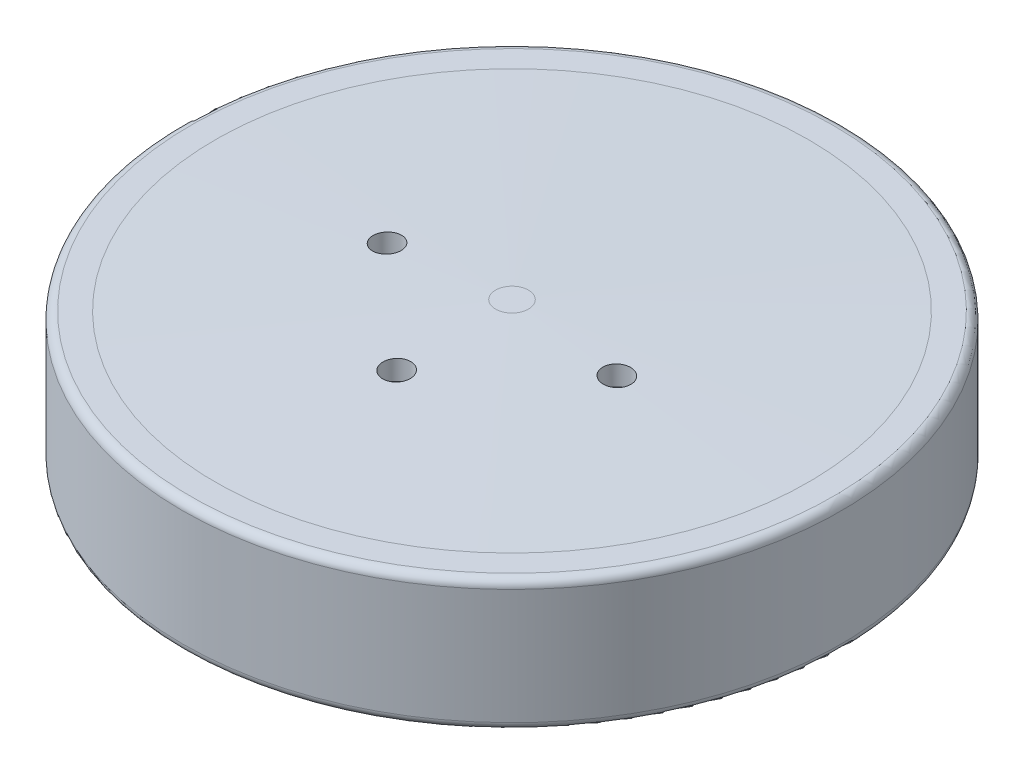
from build123d import *

# Parameters (mm, degrees)
CIRPATTERN1_COUNT                                    = 12
FILLET1_R                                            = 1.5875
F_1_4_28_TAPPED_HOLE1_D                              = 5.4102
CBORE_FOR_1_4_BINDING_HEAD_MACHINE_SCREW_D           = 2.54
CBORE_FOR_1_4_BINDING_HEAD_MACHINE_SCREW_DEPTH       = 9.2964
CBORE_FOR_1_4_BINDING_HEAD_MACHINE_SCREW_CBORE_D     = 14.2875
CBORE_FOR_1_4_BINDING_HEAD_MACHINE_SCREW_CBORE_DEPTH = 5.08
CBORE_FOR_1_4_BINDING_HEAD_MACHINE_SCREW_TIP         = 0.763092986


with BuildPart() as part:
    # Sketch1 → Revolve1 (revolve)
    with BuildSketch(Plane.XY, mode=Mode.PRIVATE) as revolve1_sk:
        with BuildLine():
            Line((-63.5, 0), (-42.5, 0))
            Line((-42.5, 0), (-42.5, 14.605))
            ThreePointArc((-42.5, 14.605), (-41.57006403, 16.85006403), (-39.325, 17.78))
            Line((-39.325, 17.78), (0, 17.78))
            Line((0, 17.78), (0, 27.284848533))
            Line((0, 27.284848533), (-3.175, 27.284848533))
            Line((-3.175, 27.284848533), (-57.15, 25.4))
            Line((-57.15, 25.4), (-63.5, 25.4))
            Line((-63.5, 25.4), (-63.5, 0))
        make_face()
    revolve(revolve1_sk.sketch.rotate(Axis((0, 0, 0), (0, 1, 0)), 270), axis=Axis((0, 0, 0), (0, 1, 0)))

    # Sketch2 → O-Ring 2-244 (revolve, cut)
    with BuildSketch(Plane.XY, mode=Mode.PRIVATE) as o_ring_2_244_sk:
        with BuildLine():
            Line((-58.5216, 0), (-53.6448, 0))
            ThreePointArc((-53.6448, 0), (-53.734602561, 0.037197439), (-53.7718, 0.127))
            Line((-53.7718, 0.127), (-53.7718, 2.1971))
            ThreePointArc((-53.7718, 2.1971), (-53.901991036, 2.511408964), (-54.2163, 2.6416))
            Line((-54.2163, 2.6416), (-57.9501, 2.6416))
            ThreePointArc((-57.9501, 2.6416), (-58.264408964, 2.511408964), (-58.3946, 2.1971))
            Line((-58.3946, 2.1971), (-58.3946, 0.127))
            ThreePointArc((-58.3946, 0.127), (-58.431797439, 0.037197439), (-58.5216, 0))
        make_face()
    revolve(o_ring_2_244_sk.sketch.rotate(Axis((0, 0, 0), (0, 1, 0)), 270), axis=Axis((0, 0, 0), (0, 1, 0)), mode=Mode.SUBTRACT)

    # Sketch4 → 8-32 Tapped Hole1 (revolve, cut)
    with BuildSketch(Plane(origin=(-47.8028, 0, 0), x_dir=(0, 0, -1), z_dir=(1, 0, 0))):
        Polygon((0, 0), (0, 17.547806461), (1.7272, 16.51), (1.7272, 0), align=None)
    f_8_32_tapped_hole1 = revolve(axis=Axis((-47.8028, -6.35, 0), (0, 1, 0)), mode=Mode.SUBTRACT)

    # CirPattern1: 8-32 Tapped Hole1 ×12 about axis
    cirpattern1_axis = Axis((0, 0, 0), (0, 1, 0))
    for i in range(1, CIRPATTERN1_COUNT):
        add(f_8_32_tapped_hole1.rotate(cirpattern1_axis, i * 360 / CIRPATTERN1_COUNT), mode=Mode.SUBTRACT)

    # Fillet1
    fillet1_edges = [part.edges().sort_by_distance(p)[0] for p in [
        (0, 0, 63.5),
        (0, 25.4, 63.5),
    ]]
    fillet(fillet1_edges, radius=FILLET1_R)

    # 1_4-28 Tapped Hole1 (through all)
    with Locations(Plane(origin=(0, 17.78, 0), x_dir=(-1, 0, 0), z_dir=(0, -1, 0))):
        with Locations((0, -22.225), (-22.140427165, -1.937036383), (22.140427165, -1.937036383)):
            Hole(F_1_4_28_TAPPED_HOLE1_D / 2)

    # CBORE for 1_4 Binding Head Machine Screw
    with Locations(Plane(origin=(0, 17.78, 0), x_dir=(-1, 0, 0), z_dir=(0, -1, 0))):
        with Locations((22.140427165, -1.937036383), (0, -22.225), (-22.140427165, -1.937036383)):
            CounterBoreHole(CBORE_FOR_1_4_BINDING_HEAD_MACHINE_SCREW_D / 2, CBORE_FOR_1_4_BINDING_HEAD_MACHINE_SCREW_CBORE_D / 2, CBORE_FOR_1_4_BINDING_HEAD_MACHINE_SCREW_CBORE_DEPTH, depth=CBORE_FOR_1_4_BINDING_HEAD_MACHINE_SCREW_DEPTH)
            with Locations((0, 0, -(CBORE_FOR_1_4_BINDING_HEAD_MACHINE_SCREW_DEPTH + CBORE_FOR_1_4_BINDING_HEAD_MACHINE_SCREW_TIP / 2))):  # 118° drill point
                Cone(0, CBORE_FOR_1_4_BINDING_HEAD_MACHINE_SCREW_D / 2, CBORE_FOR_1_4_BINDING_HEAD_MACHINE_SCREW_TIP, mode=Mode.SUBTRACT)


solid = part.part
